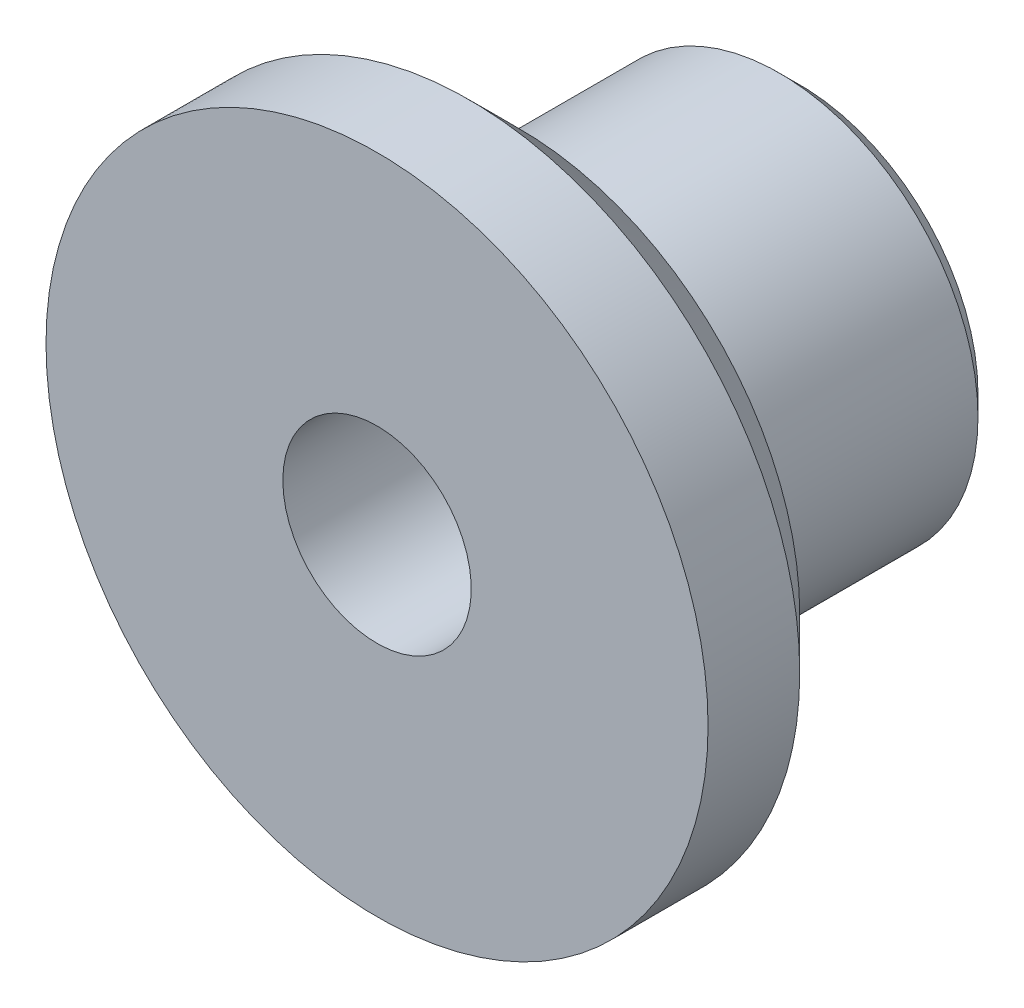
from build123d import *

# Parameters (mm, degrees)
SKETCH1_R           = 3.9
SKETCH1_R_2         = 1.85
BOSS_EXTRUDE1_DEPTH = 8.3
SKETCH2_R           = 6.5
BOSS_EXTRUDE2_DEPTH = 2.8
CHAMFER1_SIZE       = 1
SKETCH3_R           = 1.85
CUT_EXTRUDE1_DEPTH  = 13.385071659
CHAMFER2_SIZE       = 0.4
CHAMFER3_SIZE       = 0.2


with BuildPart() as part:
    # Sketch1 → Boss-Extrude1 (new body)
    with BuildSketch(Plane.XY):
        with Locations(Location((0, 0, 0), (0, 0, 180))):
            Circle(SKETCH1_R)
        with Locations(Location((0, 0, 0), (0, 0, 180))):
            Circle(SKETCH1_R_2, mode=Mode.SUBTRACT)
    extrude(amount=BOSS_EXTRUDE1_DEPTH)

    # Sketch2 → Boss-Extrude2 (add)
    with BuildSketch(Plane.XY.offset(8.3)):
        Circle(SKETCH2_R)
    extrude(amount=-BOSS_EXTRUDE2_DEPTH)

    # Chamfer1
    chamfer1_edges = [part.edges().sort_by_distance(p)[0] for p in [
        (-6.5, 0, 5.5),
    ]]
    chamfer(chamfer1_edges, length=CHAMFER1_SIZE)

    # Sketch3 → Cut-Extrude1 (cut, through all)
    with BuildSketch(Plane.XY.offset(8.3)):
        with Locations(Location((0, 0, 0), (0, 0, 180))):
            Circle(SKETCH3_R)
    extrude(amount=-CUT_EXTRUDE1_DEPTH, mode=Mode.SUBTRACT)

    # Chamfer2
    chamfer2_edges = [part.edges().sort_by_distance(p)[0] for p in [
        (3.9, 0, 0),
        (1.85, 0, 0),
    ]]
    chamfer(chamfer2_edges, length=CHAMFER2_SIZE)

    # Chamfer3
    chamfer3_edges = [part.edges().sort_by_distance(p)[0] for p in [
        (3.9, 0, 5.5),
    ]]
    chamfer(chamfer3_edges, length=CHAMFER3_SIZE)


solid = part.part
